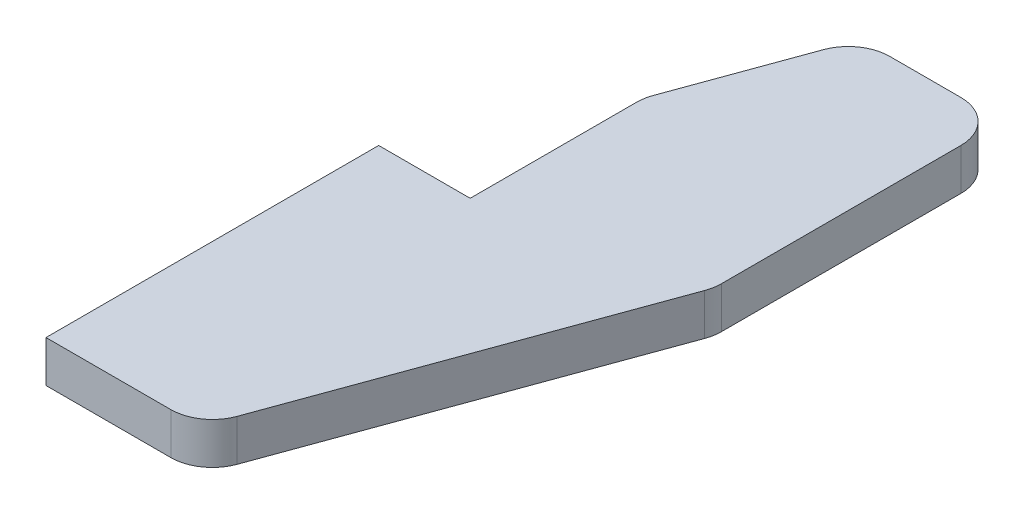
ISO-10303-21;
HEADER;
FILE_DESCRIPTION(('STEP AP214'),'2;1');
FILE_NAME('part.step','',(''),(''),'','','');
FILE_SCHEMA(('AUTOMOTIVE_DESIGN { 1 0 10303 214 1 1 1 1 }'));
ENDSEC;
DATA;
#1=APPLICATION_CONTEXT('core data for automotive mechanical design processes');
#2=APPLICATION_PROTOCOL_DEFINITION('international standard','automotive_design',2000,#1);
#3=PRODUCT_CONTEXT('',#1,'mechanical');
#4=PRODUCT('Part','Part','',(#3));
#5=PRODUCT_RELATED_PRODUCT_CATEGORY('part','',(#4));
#6=PRODUCT_DEFINITION_FORMATION('','',#4);
#7=PRODUCT_DEFINITION_CONTEXT('part definition',#1,'design');
#8=PRODUCT_DEFINITION('design','',#6,#7);
#9=PRODUCT_DEFINITION_SHAPE('','',#8);
#10=(LENGTH_UNIT() NAMED_UNIT(*) SI_UNIT(.MILLI.,.METRE.));
#11=(NAMED_UNIT(*) PLANE_ANGLE_UNIT() SI_UNIT($,.RADIAN.));
#12=(NAMED_UNIT(*) SI_UNIT($,.STERADIAN.) SOLID_ANGLE_UNIT());
#13=UNCERTAINTY_MEASURE_WITH_UNIT(LENGTH_MEASURE(1.E-05),#10,'distance_accuracy_value','');
#14=(GEOMETRIC_REPRESENTATION_CONTEXT(3) GLOBAL_UNCERTAINTY_ASSIGNED_CONTEXT((#13)) GLOBAL_UNIT_ASSIGNED_CONTEXT((#10,
#11,#12)) REPRESENTATION_CONTEXT('',''));
#15=CARTESIAN_POINT('',(0.,0.,0.));
#16=DIRECTION('',(0.,0.,1.));
#17=DIRECTION('',(1.,0.,0.));
#18=AXIS2_PLACEMENT_3D('',#15,#16,#17);
#19=CARTESIAN_POINT('',(10.9999999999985,-2.5,-20.0000000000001));
#20=DIRECTION('',(-1.,0.,0.));
#21=DIRECTION('',(0.,0.,1.));
#22=AXIS2_PLACEMENT_3D('',#19,#20,#21);
#23=PLANE('',#22);
#24=DIRECTION('',(0.,0.,1.));
#25=VECTOR('',#24,1.);
#26=CARTESIAN_POINT('',(10.9999999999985,2.5,-20.0000000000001));
#27=LINE('',#26,#25);
#28=CARTESIAN_POINT('',(10.9999999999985,2.5,-20.0000000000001));
#29=VERTEX_POINT('',#28);
#30=CARTESIAN_POINT('',(10.9999999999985,2.5,0.));
#31=VERTEX_POINT('',#30);
#32=EDGE_CURVE('E159',#29,#31,#27,.T.);
#33=ORIENTED_EDGE('',*,*,#32,.F.);
#34=DIRECTION('',(0.,1.,0.));
#35=VECTOR('',#34,1.);
#36=CARTESIAN_POINT('',(10.9999999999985,-2.5,-20.0000000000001));
#37=LINE('',#36,#35);
#38=CARTESIAN_POINT('',(10.9999999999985,-2.5,-20.0000000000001));
#39=VERTEX_POINT('',#38);
#40=EDGE_CURVE('E11',#39,#29,#37,.T.);
#41=ORIENTED_EDGE('',*,*,#40,.F.);
#42=DIRECTION('',(0.,0.,1.));
#43=VECTOR('',#42,1.);
#44=CARTESIAN_POINT('',(10.9999999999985,-2.5,-20.0000000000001));
#45=LINE('',#44,#43);
#46=CARTESIAN_POINT('',(10.9999999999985,-2.5,0.));
#47=VERTEX_POINT('',#46);
#48=EDGE_CURVE('E194',#39,#47,#45,.T.);
#49=ORIENTED_EDGE('',*,*,#48,.T.);
#50=DIRECTION('',(0.,1.,0.));
#51=VECTOR('',#50,1.);
#52=CARTESIAN_POINT('',(10.9999999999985,-2.5,0.));
#53=LINE('',#52,#51);
#54=EDGE_CURVE('E35',#47,#31,#53,.T.);
#55=ORIENTED_EDGE('',*,*,#54,.T.);
#56=EDGE_LOOP('',(#33,#41,#49,#55));
#57=FACE_BOUND('',#56,.T.);
#58=ADVANCED_FACE('F32',(#57),#23,.T.);
#59=CARTESIAN_POINT('',(16.,-2.5,-20.));
#60=DIRECTION('',(0.,1.,0.));
#61=DIRECTION('',(0.,0.,1.));
#62=AXIS2_PLACEMENT_3D('',#59,#60,#61);
#63=CYLINDRICAL_SURFACE('',#62,5.0000000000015);
#64=CARTESIAN_POINT('',(16.,2.5,-20.));
#65=DIRECTION('',(0.,1.,0.));
#66=DIRECTION('',(0.,0.,1.));
#67=AXIS2_PLACEMENT_3D('',#64,#65,#66);
#68=CIRCLE('',#67,5.0000000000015);
#69=CARTESIAN_POINT('',(11.3015368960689,2.5,-21.7101007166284));
#70=VERTEX_POINT('',#69);
#71=EDGE_CURVE('E192',#70,#29,#68,.T.);
#72=ORIENTED_EDGE('',*,*,#71,.F.);
#73=DIRECTION('',(0.,1.,0.));
#74=VECTOR('',#73,1.);
#75=CARTESIAN_POINT('',(11.3015368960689,-2.5,-21.7101007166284));
#76=LINE('',#75,#74);
#77=CARTESIAN_POINT('',(11.3015368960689,-2.5,-21.7101007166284));
#78=VERTEX_POINT('',#77);
#79=EDGE_CURVE('E41',#78,#70,#76,.T.);
#80=ORIENTED_EDGE('',*,*,#79,.F.);
#81=CARTESIAN_POINT('',(16.,-2.5,-20.));
#82=DIRECTION('',(0.,1.,0.));
#83=DIRECTION('',(0.,0.,1.));
#84=AXIS2_PLACEMENT_3D('',#81,#82,#83);
#85=CIRCLE('',#84,5.0000000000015);
#86=EDGE_CURVE('E149',#78,#39,#85,.T.);
#87=ORIENTED_EDGE('',*,*,#86,.T.);
#88=ORIENTED_EDGE('',*,*,#40,.T.);
#89=EDGE_LOOP('',(#72,#80,#87,#88));
#90=FACE_BOUND('',#89,.T.);
#91=ADVANCED_FACE('F216',(#90),#63,.T.);
#92=CARTESIAN_POINT('',(16.7610904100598,-2.5,-36.7101007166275));
#93=DIRECTION('',(-0.939692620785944,0.,-0.342020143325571));
#94=DIRECTION('',(-0.342020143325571,0.,0.939692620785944));
#95=AXIS2_PLACEMENT_3D('',#92,#93,#94);
#96=PLANE('',#95);
#97=DIRECTION('',(-0.342020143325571,0.,0.939692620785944));
#98=VECTOR('',#97,1.);
#99=CARTESIAN_POINT('',(16.7610904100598,2.5,-36.7101007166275));
#100=LINE('',#99,#98);
#101=CARTESIAN_POINT('',(16.76109041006,2.5,-36.7101007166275));
#102=VERTEX_POINT('',#101);
#103=EDGE_CURVE('E136',#102,#70,#100,.T.);
#104=ORIENTED_EDGE('',*,*,#103,.F.);
#105=DIRECTION('',(0.,1.,0.));
#106=VECTOR('',#105,1.);
#107=CARTESIAN_POINT('',(16.76109041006,-2.5,-36.7101007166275));
#108=LINE('',#107,#106);
#109=CARTESIAN_POINT('',(16.76109041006,-2.5,-36.7101007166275));
#110=VERTEX_POINT('',#109);
#111=EDGE_CURVE('E131',#110,#102,#108,.T.);
#112=ORIENTED_EDGE('',*,*,#111,.F.);
#113=DIRECTION('',(-0.342020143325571,0.,0.939692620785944));
#114=VECTOR('',#113,1.);
#115=CARTESIAN_POINT('',(16.7610904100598,-2.5,-36.7101007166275));
#116=LINE('',#115,#114);
#117=EDGE_CURVE('E134',#110,#78,#116,.T.);
#118=ORIENTED_EDGE('',*,*,#117,.T.);
#119=ORIENTED_EDGE('',*,*,#79,.T.);
#120=EDGE_LOOP('',(#104,#112,#118,#119));
#121=FACE_BOUND('',#120,.T.);
#122=ADVANCED_FACE('F133',(#121),#96,.T.);
#123=CARTESIAN_POINT('',(21.45955351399,-2.5,-35.));
#124=DIRECTION('',(0.,1.,0.));
#125=DIRECTION('',(0.,0.,1.));
#126=AXIS2_PLACEMENT_3D('',#123,#124,#125);
#127=CYLINDRICAL_SURFACE('',#126,5.00000000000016);
#128=CARTESIAN_POINT('',(21.45955351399,2.5,-35.));
#129=DIRECTION('',(0.,1.,0.));
#130=DIRECTION('',(0.,0.,1.));
#131=AXIS2_PLACEMENT_3D('',#128,#129,#130);
#132=CIRCLE('',#131,5.00000000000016);
#133=CARTESIAN_POINT('',(21.45955351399,2.5,-40.));
#134=VERTEX_POINT('',#133);
#135=EDGE_CURVE('E189',#134,#102,#132,.T.);
#136=ORIENTED_EDGE('',*,*,#135,.F.);
#137=DIRECTION('',(0.,1.,0.));
#138=VECTOR('',#137,1.);
#139=CARTESIAN_POINT('',(21.45955351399,-2.5,-40.));
#140=LINE('',#139,#138);
#141=CARTESIAN_POINT('',(21.45955351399,-2.5,-40.));
#142=VERTEX_POINT('',#141);
#143=EDGE_CURVE('E141',#142,#134,#140,.T.);
#144=ORIENTED_EDGE('',*,*,#143,.F.);
#145=CARTESIAN_POINT('',(21.45955351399,-2.5,-35.));
#146=DIRECTION('',(0.,1.,0.));
#147=DIRECTION('',(0.,0.,1.));
#148=AXIS2_PLACEMENT_3D('',#145,#146,#147);
#149=CIRCLE('',#148,5.00000000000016);
#150=EDGE_CURVE('E147',#142,#110,#149,.T.);
#151=ORIENTED_EDGE('',*,*,#150,.T.);
#152=ORIENTED_EDGE('',*,*,#111,.T.);
#153=EDGE_LOOP('',(#136,#144,#151,#152));
#154=FACE_BOUND('',#153,.T.);
#155=ADVANCED_FACE('F151',(#154),#127,.T.);
#156=CARTESIAN_POINT('',(30.,-2.5,-40.));
#157=DIRECTION('',(0.,0.,-1.));
#158=DIRECTION('',(-1.,0.,0.));
#159=AXIS2_PLACEMENT_3D('',#156,#157,#158);
#160=PLANE('',#159);
#161=DIRECTION('',(-1.,0.,0.));
#162=VECTOR('',#161,1.);
#163=CARTESIAN_POINT('',(30.,2.5,-40.));
#164=LINE('',#163,#162);
#165=CARTESIAN_POINT('',(30.,2.5,-40.));
#166=VERTEX_POINT('',#165);
#167=EDGE_CURVE('E186',#166,#134,#164,.T.);
#168=ORIENTED_EDGE('',*,*,#167,.F.);
#169=DIRECTION('',(0.,1.,0.));
#170=VECTOR('',#169,1.);
#171=CARTESIAN_POINT('',(30.,-2.5,-40.));
#172=LINE('',#171,#170);
#173=CARTESIAN_POINT('',(30.,-2.5,-40.));
#174=VERTEX_POINT('',#173);
#175=EDGE_CURVE('E198',#174,#166,#172,.T.);
#176=ORIENTED_EDGE('',*,*,#175,.F.);
#177=DIRECTION('',(-1.,0.,0.));
#178=VECTOR('',#177,1.);
#179=CARTESIAN_POINT('',(30.,-2.5,-40.));
#180=LINE('',#179,#178);
#181=EDGE_CURVE('E152',#174,#142,#180,.T.);
#182=ORIENTED_EDGE('',*,*,#181,.T.);
#183=ORIENTED_EDGE('',*,*,#143,.T.);
#184=EDGE_LOOP('',(#168,#176,#182,#183));
#185=FACE_BOUND('',#184,.T.);
#186=ADVANCED_FACE('F229',(#185),#160,.T.);
#187=CARTESIAN_POINT('',(30.,-2.5,-35.));
#188=DIRECTION('',(0.,1.,0.));
#189=DIRECTION('',(0.,0.,1.));
#190=AXIS2_PLACEMENT_3D('',#187,#188,#189);
#191=CYLINDRICAL_SURFACE('',#190,5.);
#192=CARTESIAN_POINT('',(30.,2.5,-35.));
#193=DIRECTION('',(0.,1.,0.));
#194=DIRECTION('',(0.,0.,1.));
#195=AXIS2_PLACEMENT_3D('',#192,#193,#194);
#196=CIRCLE('',#195,5.);
#197=CARTESIAN_POINT('',(35.,2.5,-35.));
#198=VERTEX_POINT('',#197);
#199=EDGE_CURVE('E183',#198,#166,#196,.T.);
#200=ORIENTED_EDGE('',*,*,#199,.F.);
#201=DIRECTION('',(0.,1.,0.));
#202=VECTOR('',#201,1.);
#203=CARTESIAN_POINT('',(35.,-2.5,-35.));
#204=LINE('',#203,#202);
#205=CARTESIAN_POINT('',(35.,-2.5,-35.));
#206=VERTEX_POINT('',#205);
#207=EDGE_CURVE('E200',#206,#198,#204,.T.);
#208=ORIENTED_EDGE('',*,*,#207,.F.);
#209=CARTESIAN_POINT('',(30.,-2.5,-35.));
#210=DIRECTION('',(0.,1.,0.));
#211=DIRECTION('',(0.,0.,1.));
#212=AXIS2_PLACEMENT_3D('',#209,#210,#211);
#213=CIRCLE('',#212,5.);
#214=EDGE_CURVE('E154',#206,#174,#213,.T.);
#215=ORIENTED_EDGE('',*,*,#214,.T.);
#216=ORIENTED_EDGE('',*,*,#175,.T.);
#217=EDGE_LOOP('',(#200,#208,#215,#216));
#218=FACE_BOUND('',#217,.T.);
#219=ADVANCED_FACE('F232',(#218),#191,.T.);
#220=CARTESIAN_POINT('',(35.,-2.5,-6.212161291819));
#221=DIRECTION('',(1.,0.,0.));
#222=DIRECTION('',(0.,0.,-1.));
#223=AXIS2_PLACEMENT_3D('',#220,#221,#222);
#224=PLANE('',#223);
#225=DIRECTION('',(0.,0.,-1.));
#226=VECTOR('',#225,1.);
#227=CARTESIAN_POINT('',(35.,2.5,-6.212161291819));
#228=LINE('',#227,#226);
#229=CARTESIAN_POINT('',(35.0000000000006,2.5,-6.212161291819));
#230=VERTEX_POINT('',#229);
#231=EDGE_CURVE('E180',#230,#198,#228,.T.);
#232=ORIENTED_EDGE('',*,*,#231,.F.);
#233=DIRECTION('',(0.,1.,0.));
#234=VECTOR('',#233,1.);
#235=CARTESIAN_POINT('',(35.0000000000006,-2.5,-6.212161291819));
#236=LINE('',#235,#234);
#237=CARTESIAN_POINT('',(35.0000000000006,-2.5,-6.212161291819));
#238=VERTEX_POINT('',#237);
#239=EDGE_CURVE('E202',#238,#230,#236,.T.);
#240=ORIENTED_EDGE('',*,*,#239,.F.);
#241=DIRECTION('',(0.,0.,-1.));
#242=VECTOR('',#241,1.);
#243=CARTESIAN_POINT('',(35.,-2.5,-6.212161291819));
#244=LINE('',#243,#242);
#245=EDGE_CURVE('E372',#238,#206,#244,.T.);
#246=ORIENTED_EDGE('',*,*,#245,.T.);
#247=ORIENTED_EDGE('',*,*,#207,.T.);
#248=EDGE_LOOP('',(#232,#240,#246,#247));
#249=FACE_BOUND('',#248,.T.);
#250=ADVANCED_FACE('F236',(#249),#224,.T.);
#251=CARTESIAN_POINT('',(30.,-2.5,-6.212161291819));
#252=DIRECTION('',(0.,1.,0.));
#253=DIRECTION('',(0.,0.,1.));
#254=AXIS2_PLACEMENT_3D('',#251,#252,#253);
#255=CYLINDRICAL_SURFACE('',#254,5.00000000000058);
#256=CARTESIAN_POINT('',(30.,2.5,-6.212161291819));
#257=DIRECTION('',(0.,1.,0.));
#258=DIRECTION('',(0.,0.,1.));
#259=AXIS2_PLACEMENT_3D('',#256,#257,#258);
#260=CIRCLE('',#259,5.00000000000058);
#261=CARTESIAN_POINT('',(34.6984631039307,2.5,-4.50206057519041));
#262=VERTEX_POINT('',#261);
#263=EDGE_CURVE('E177',#262,#230,#260,.T.);
#264=ORIENTED_EDGE('',*,*,#263,.F.);
#265=DIRECTION('',(0.,1.,0.));
#266=VECTOR('',#265,1.);
#267=CARTESIAN_POINT('',(34.6984631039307,-2.5,-4.50206057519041));
#268=LINE('',#267,#266);
#269=CARTESIAN_POINT('',(34.6984631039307,-2.5,-4.50206057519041));
#270=VERTEX_POINT('',#269);
#271=EDGE_CURVE('E204',#270,#262,#268,.T.);
#272=ORIENTED_EDGE('',*,*,#271,.F.);
#273=CARTESIAN_POINT('',(30.,-2.5,-6.212161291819));
#274=DIRECTION('',(0.,1.,0.));
#275=DIRECTION('',(0.,0.,1.));
#276=AXIS2_PLACEMENT_3D('',#273,#274,#275);
#277=CIRCLE('',#276,5.00000000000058);
#278=EDGE_CURVE('E368',#270,#238,#277,.T.);
#279=ORIENTED_EDGE('',*,*,#278,.T.);
#280=ORIENTED_EDGE('',*,*,#239,.T.);
#281=EDGE_LOOP('',(#264,#272,#279,#280));
#282=FACE_BOUND('',#281,.T.);
#283=ADVANCED_FACE('F240',(#282),#255,.T.);
#284=CARTESIAN_POINT('',(19.69846310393,-2.5,36.710100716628));
#285=DIRECTION('',(0.939692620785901,0.,0.342020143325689));
#286=DIRECTION('',(0.342020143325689,0.,-0.939692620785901));
#287=AXIS2_PLACEMENT_3D('',#284,#285,#286);
#288=PLANE('',#287);
#289=DIRECTION('',(0.342020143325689,0.,-0.939692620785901));
#290=VECTOR('',#289,1.);
#291=CARTESIAN_POINT('',(19.69846310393,2.5,36.710100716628));
#292=LINE('',#291,#290);
#293=CARTESIAN_POINT('',(19.6984631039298,2.5,36.710100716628));
#294=VERTEX_POINT('',#293);
#295=EDGE_CURVE('E174',#294,#262,#292,.T.);
#296=ORIENTED_EDGE('',*,*,#295,.F.);
#297=DIRECTION('',(0.,1.,0.));
#298=VECTOR('',#297,1.);
#299=CARTESIAN_POINT('',(19.6984631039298,-2.5,36.710100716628));
#300=LINE('',#299,#298);
#301=CARTESIAN_POINT('',(19.6984631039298,-2.5,36.710100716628));
#302=VERTEX_POINT('',#301);
#303=EDGE_CURVE('E206',#302,#294,#300,.T.);
#304=ORIENTED_EDGE('',*,*,#303,.F.);
#305=DIRECTION('',(0.342020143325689,0.,-0.939692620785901));
#306=VECTOR('',#305,1.);
#307=CARTESIAN_POINT('',(19.69846310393,-2.5,36.710100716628));
#308=LINE('',#307,#306);
#309=EDGE_CURVE('E379',#302,#270,#308,.T.);
#310=ORIENTED_EDGE('',*,*,#309,.T.);
#311=ORIENTED_EDGE('',*,*,#271,.T.);
#312=EDGE_LOOP('',(#296,#304,#310,#311));
#313=FACE_BOUND('',#312,.T.);
#314=ADVANCED_FACE('F244',(#313),#288,.T.);
#315=CARTESIAN_POINT('',(15.,-2.5,35.));
#316=DIRECTION('',(0.,1.,0.));
#317=DIRECTION('',(0.,0.,1.));
#318=AXIS2_PLACEMENT_3D('',#315,#316,#317);
#319=CYLINDRICAL_SURFACE('',#318,5.00000000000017);
#320=CARTESIAN_POINT('',(15.,2.5,35.));
#321=DIRECTION('',(0.,1.,0.));
#322=DIRECTION('',(0.,0.,1.));
#323=AXIS2_PLACEMENT_3D('',#320,#321,#322);
#324=CIRCLE('',#323,5.00000000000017);
#325=CARTESIAN_POINT('',(15.,2.5,40.));
#326=VERTEX_POINT('',#325);
#327=EDGE_CURVE('E171',#326,#294,#324,.T.);
#328=ORIENTED_EDGE('',*,*,#327,.F.);
#329=DIRECTION('',(0.,1.,0.));
#330=VECTOR('',#329,1.);
#331=CARTESIAN_POINT('',(15.,-2.5,40.));
#332=LINE('',#331,#330);
#333=CARTESIAN_POINT('',(15.,-2.5,40.));
#334=VERTEX_POINT('',#333);
#335=EDGE_CURVE('E208',#334,#326,#332,.T.);
#336=ORIENTED_EDGE('',*,*,#335,.F.);
#337=CARTESIAN_POINT('',(15.,-2.5,35.));
#338=DIRECTION('',(0.,1.,0.));
#339=DIRECTION('',(0.,0.,1.));
#340=AXIS2_PLACEMENT_3D('',#337,#338,#339);
#341=CIRCLE('',#340,5.00000000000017);
#342=EDGE_CURVE('E361',#334,#302,#341,.T.);
#343=ORIENTED_EDGE('',*,*,#342,.T.);
#344=ORIENTED_EDGE('',*,*,#303,.T.);
#345=EDGE_LOOP('',(#328,#336,#343,#344));
#346=FACE_BOUND('',#345,.T.);
#347=ADVANCED_FACE('F248',(#346),#319,.T.);
#348=CARTESIAN_POINT('',(0.,-2.5,40.));
#349=DIRECTION('',(0.,0.,1.));
#350=DIRECTION('',(1.,0.,0.));
#351=AXIS2_PLACEMENT_3D('',#348,#349,#350);
#352=PLANE('',#351);
#353=DIRECTION('',(1.,0.,0.));
#354=VECTOR('',#353,1.);
#355=CARTESIAN_POINT('',(0.,2.5,40.));
#356=LINE('',#355,#354);
#357=CARTESIAN_POINT('',(0.,2.5,40.));
#358=VERTEX_POINT('',#357);
#359=EDGE_CURVE('E168',#358,#326,#356,.T.);
#360=ORIENTED_EDGE('',*,*,#359,.F.);
#361=DIRECTION('',(0.,1.,0.));
#362=VECTOR('',#361,1.);
#363=CARTESIAN_POINT('',(0.,-2.5,40.));
#364=LINE('',#363,#362);
#365=CARTESIAN_POINT('',(0.,-2.5,40.));
#366=VERTEX_POINT('',#365);
#367=EDGE_CURVE('E210',#366,#358,#364,.T.);
#368=ORIENTED_EDGE('',*,*,#367,.F.);
#369=DIRECTION('',(1.,0.,0.));
#370=VECTOR('',#369,1.);
#371=CARTESIAN_POINT('',(0.,-2.5,40.));
#372=LINE('',#371,#370);
#373=EDGE_CURVE('E357',#366,#334,#372,.T.);
#374=ORIENTED_EDGE('',*,*,#373,.T.);
#375=ORIENTED_EDGE('',*,*,#335,.T.);
#376=EDGE_LOOP('',(#360,#368,#374,#375));
#377=FACE_BOUND('',#376,.T.);
#378=ADVANCED_FACE('F252',(#377),#352,.T.);
#379=CARTESIAN_POINT('',(0.,-2.5,0.));
#380=DIRECTION('',(-1.,0.,0.));
#381=DIRECTION('',(0.,0.,1.));
#382=AXIS2_PLACEMENT_3D('',#379,#380,#381);
#383=PLANE('',#382);
#384=DIRECTION('',(0.,0.,1.));
#385=VECTOR('',#384,1.);
#386=CARTESIAN_POINT('',(0.,2.5,0.));
#387=LINE('',#386,#385);
#388=CARTESIAN_POINT('',(0.,2.5,0.));
#389=VERTEX_POINT('',#388);
#390=EDGE_CURVE('E165',#389,#358,#387,.T.);
#391=ORIENTED_EDGE('',*,*,#390,.F.);
#392=DIRECTION('',(0.,1.,0.));
#393=VECTOR('',#392,1.);
#394=CARTESIAN_POINT('',(0.,-2.5,0.));
#395=LINE('',#394,#393);
#396=CARTESIAN_POINT('',(0.,-2.5,0.));
#397=VERTEX_POINT('',#396);
#398=EDGE_CURVE('E211',#397,#389,#395,.T.);
#399=ORIENTED_EDGE('',*,*,#398,.F.);
#400=DIRECTION('',(0.,0.,1.));
#401=VECTOR('',#400,1.);
#402=CARTESIAN_POINT('',(0.,-2.5,0.));
#403=LINE('',#402,#401);
#404=EDGE_CURVE('E383',#397,#366,#403,.T.);
#405=ORIENTED_EDGE('',*,*,#404,.T.);
#406=ORIENTED_EDGE('',*,*,#367,.T.);
#407=EDGE_LOOP('',(#391,#399,#405,#406));
#408=FACE_BOUND('',#407,.T.);
#409=ADVANCED_FACE('F256',(#408),#383,.T.);
#410=CARTESIAN_POINT('',(10.9999999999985,-2.5,0.));
#411=DIRECTION('',(0.,0.,-1.));
#412=DIRECTION('',(-1.,0.,0.));
#413=AXIS2_PLACEMENT_3D('',#410,#411,#412);
#414=PLANE('',#413);
#415=DIRECTION('',(-1.,0.,0.));
#416=VECTOR('',#415,1.);
#417=CARTESIAN_POINT('',(10.9999999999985,2.5,0.));
#418=LINE('',#417,#416);
#419=EDGE_CURVE('E162',#31,#389,#418,.T.);
#420=ORIENTED_EDGE('',*,*,#419,.F.);
#421=ORIENTED_EDGE('',*,*,#54,.F.);
#422=DIRECTION('',(-1.,0.,0.));
#423=VECTOR('',#422,1.);
#424=CARTESIAN_POINT('',(10.9999999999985,-2.5,0.));
#425=LINE('',#424,#423);
#426=EDGE_CURVE('E385',#47,#397,#425,.T.);
#427=ORIENTED_EDGE('',*,*,#426,.T.);
#428=ORIENTED_EDGE('',*,*,#398,.T.);
#429=EDGE_LOOP('',(#420,#421,#427,#428));
#430=FACE_BOUND('',#429,.T.);
#431=ADVANCED_FACE('F213',(#430),#414,.T.);
#432=CARTESIAN_POINT('',(15.,-2.5,35.));
#433=DIRECTION('',(0.,1.,0.));
#434=DIRECTION('',(0.,0.,1.));
#435=AXIS2_PLACEMENT_3D('',#432,#433,#434);
#436=PLANE('',#435);
#437=ORIENTED_EDGE('',*,*,#48,.F.);
#438=ORIENTED_EDGE('',*,*,#86,.F.);
#439=ORIENTED_EDGE('',*,*,#117,.F.);
#440=ORIENTED_EDGE('',*,*,#150,.F.);
#441=ORIENTED_EDGE('',*,*,#181,.F.);
#442=ORIENTED_EDGE('',*,*,#214,.F.);
#443=ORIENTED_EDGE('',*,*,#245,.F.);
#444=ORIENTED_EDGE('',*,*,#278,.F.);
#445=ORIENTED_EDGE('',*,*,#309,.F.);
#446=ORIENTED_EDGE('',*,*,#342,.F.);
#447=ORIENTED_EDGE('',*,*,#373,.F.);
#448=ORIENTED_EDGE('',*,*,#404,.F.);
#449=ORIENTED_EDGE('',*,*,#426,.F.);
#450=EDGE_LOOP('',(#437,#438,#439,#440,#441,#442,#443,#444,#445,#446,#447,#448,#449));
#451=FACE_BOUND('',#450,.T.);
#452=ADVANCED_FACE('F145',(#451),#436,.F.);
#453=CARTESIAN_POINT('',(15.,2.5,35.));
#454=DIRECTION('',(0.,1.,0.));
#455=DIRECTION('',(0.,0.,1.));
#456=AXIS2_PLACEMENT_3D('',#453,#454,#455);
#457=PLANE('',#456);
#458=ORIENTED_EDGE('',*,*,#32,.T.);
#459=ORIENTED_EDGE('',*,*,#419,.T.);
#460=ORIENTED_EDGE('',*,*,#390,.T.);
#461=ORIENTED_EDGE('',*,*,#359,.T.);
#462=ORIENTED_EDGE('',*,*,#327,.T.);
#463=ORIENTED_EDGE('',*,*,#295,.T.);
#464=ORIENTED_EDGE('',*,*,#263,.T.);
#465=ORIENTED_EDGE('',*,*,#231,.T.);
#466=ORIENTED_EDGE('',*,*,#199,.T.);
#467=ORIENTED_EDGE('',*,*,#167,.T.);
#468=ORIENTED_EDGE('',*,*,#135,.T.);
#469=ORIENTED_EDGE('',*,*,#103,.T.);
#470=ORIENTED_EDGE('',*,*,#71,.T.);
#471=EDGE_LOOP('',(#458,#459,#460,#461,#462,#463,#464,#465,#466,#467,#468,#469,#470));
#472=FACE_BOUND('',#471,.T.);
#473=ADVANCED_FACE('F215',(#472),#457,.T.);
#474=CLOSED_SHELL('',(#58,#91,#122,#155,#186,#219,#250,#283,#314,#347,#378,#409,#431,#452,#473));
#475=MANIFOLD_SOLID_BREP('B2',#474);
#476=ADVANCED_BREP_SHAPE_REPRESENTATION('',(#18,#475),#14);
#477=SHAPE_DEFINITION_REPRESENTATION(#9,#476);
ENDSEC;
END-ISO-10303-21;
